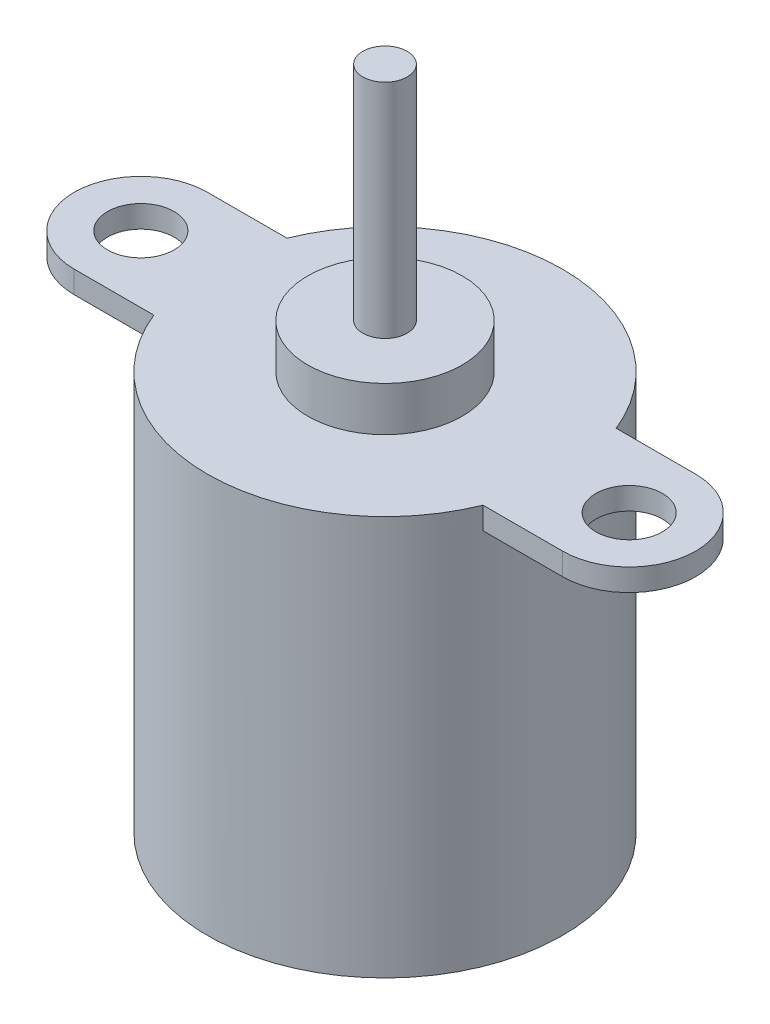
ISO-10303-21;
HEADER;
FILE_DESCRIPTION(('STEP AP214'),'2;1');
FILE_NAME('part.step','',(''),(''),'','','');
FILE_SCHEMA(('AUTOMOTIVE_DESIGN { 1 0 10303 214 1 1 1 1 }'));
ENDSEC;
DATA;
#1=APPLICATION_CONTEXT('core data for automotive mechanical design processes');
#2=APPLICATION_PROTOCOL_DEFINITION('international standard','automotive_design',2000,#1);
#3=PRODUCT_CONTEXT('',#1,'mechanical');
#4=PRODUCT('Part','Part','',(#3));
#5=PRODUCT_RELATED_PRODUCT_CATEGORY('part','',(#4));
#6=PRODUCT_DEFINITION_FORMATION('','',#4);
#7=PRODUCT_DEFINITION_CONTEXT('part definition',#1,'design');
#8=PRODUCT_DEFINITION('design','',#6,#7);
#9=PRODUCT_DEFINITION_SHAPE('','',#8);
#10=(LENGTH_UNIT() NAMED_UNIT(*) SI_UNIT(.MILLI.,.METRE.));
#11=(NAMED_UNIT(*) PLANE_ANGLE_UNIT() SI_UNIT($,.RADIAN.));
#12=(NAMED_UNIT(*) SI_UNIT($,.STERADIAN.) SOLID_ANGLE_UNIT());
#13=UNCERTAINTY_MEASURE_WITH_UNIT(LENGTH_MEASURE(1.E-05),#10,'distance_accuracy_value','');
#14=(GEOMETRIC_REPRESENTATION_CONTEXT(3) GLOBAL_UNCERTAINTY_ASSIGNED_CONTEXT((#13)) GLOBAL_UNIT_ASSIGNED_CONTEXT((#10,
#11,#12)) REPRESENTATION_CONTEXT('',''));
#15=CARTESIAN_POINT('',(0.,0.,0.));
#16=DIRECTION('',(0.,0.,1.));
#17=DIRECTION('',(1.,0.,0.));
#18=AXIS2_PLACEMENT_3D('',#15,#16,#17);
#19=CARTESIAN_POINT('',(0.,15.,0.));
#20=DIRECTION('',(0.,1.,0.));
#21=DIRECTION('',(0.,0.,1.));
#22=AXIS2_PLACEMENT_3D('',#19,#20,#21);
#23=PLANE('',#22);
#24=CARTESIAN_POINT('',(0.,15.,0.));
#25=DIRECTION('',(0.,-1.,0.));
#26=DIRECTION('',(0.,0.,-1.));
#27=AXIS2_PLACEMENT_3D('',#24,#25,#26);
#28=CIRCLE('',#27,0.5);
#29=CARTESIAN_POINT('',(0.,15.,-0.5));
#30=VERTEX_POINT('',#29);
#31=EDGE_CURVE('E20',#30,#30,#28,.T.);
#32=ORIENTED_EDGE('',*,*,#31,.F.);
#33=EDGE_LOOP('',(#32));
#34=FACE_BOUND('',#33,.T.);
#35=ADVANCED_FACE('F17',(#34),#23,.T.);
#36=CARTESIAN_POINT('',(0.,15.,0.));
#37=DIRECTION('',(0.,-1.,0.));
#38=DIRECTION('',(0.,0.,-1.));
#39=AXIS2_PLACEMENT_3D('',#36,#37,#38);
#40=CYLINDRICAL_SURFACE('',#39,0.5);
#41=CARTESIAN_POINT('',(0.,10.,0.));
#42=DIRECTION('',(0.,-1.,0.));
#43=DIRECTION('',(0.,0.,-1.));
#44=AXIS2_PLACEMENT_3D('',#41,#42,#43);
#45=CIRCLE('',#44,0.5);
#46=CARTESIAN_POINT('',(0.,10.,-0.5));
#47=VERTEX_POINT('',#46);
#48=EDGE_CURVE('E157',#47,#47,#45,.T.);
#49=ORIENTED_EDGE('',*,*,#48,.F.);
#50=EDGE_LOOP('',(#49));
#51=FACE_BOUND('',#50,.T.);
#52=ORIENTED_EDGE('',*,*,#31,.T.);
#53=EDGE_LOOP('',(#52));
#54=FACE_BOUND('',#53,.T.);
#55=ADVANCED_FACE('F164',(#51,#54),#40,.T.);
#56=CARTESIAN_POINT('',(0.,10.,0.));
#57=DIRECTION('',(0.,1.,0.));
#58=DIRECTION('',(0.,0.,1.));
#59=AXIS2_PLACEMENT_3D('',#56,#57,#58);
#60=PLANE('',#59);
#61=ORIENTED_EDGE('',*,*,#48,.T.);
#62=EDGE_LOOP('',(#61));
#63=FACE_BOUND('',#62,.T.);
#64=CARTESIAN_POINT('',(0.,10.,0.));
#65=DIRECTION('',(0.,-1.,0.));
#66=DIRECTION('',(0.,0.,-1.));
#67=AXIS2_PLACEMENT_3D('',#64,#65,#66);
#68=CIRCLE('',#67,1.74000566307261);
#69=CARTESIAN_POINT('',(0.,10.,-1.74000566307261));
#70=VERTEX_POINT('',#69);
#71=EDGE_CURVE('E102',#70,#70,#68,.T.);
#72=ORIENTED_EDGE('',*,*,#71,.F.);
#73=EDGE_LOOP('',(#72));
#74=FACE_BOUND('',#73,.T.);
#75=ADVANCED_FACE('F171',(#63,#74),#60,.T.);
#76=CARTESIAN_POINT('',(-5.5,8.5,0.));
#77=DIRECTION('',(0.,1.,0.));
#78=DIRECTION('',(0.,0.,1.));
#79=AXIS2_PLACEMENT_3D('',#76,#77,#78);
#80=PLANE('',#79);
#81=CARTESIAN_POINT('',(0.,8.5,0.));
#82=DIRECTION('',(0.,-1.,0.));
#83=DIRECTION('',(0.,0.,-1.));
#84=AXIS2_PLACEMENT_3D('',#81,#82,#83);
#85=CIRCLE('',#84,4.);
#86=CARTESIAN_POINT('',(-3.70809924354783,8.5,1.5));
#87=VERTEX_POINT('',#86);
#88=CARTESIAN_POINT('',(-3.70809924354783,8.5,-1.5));
#89=VERTEX_POINT('',#88);
#90=EDGE_CURVE('E98',#87,#89,#85,.T.);
#91=ORIENTED_EDGE('',*,*,#90,.F.);
#92=DIRECTION('',(1.,0.,0.));
#93=VECTOR('',#92,1.);
#94=CARTESIAN_POINT('',(-5.5,8.5,1.5));
#95=LINE('',#94,#93);
#96=CARTESIAN_POINT('',(-5.5,8.5,1.5));
#97=VERTEX_POINT('',#96);
#98=EDGE_CURVE('E94',#97,#87,#95,.T.);
#99=ORIENTED_EDGE('',*,*,#98,.F.);
#100=CARTESIAN_POINT('',(-5.5,8.5,0.));
#101=DIRECTION('',(0.,1.,0.));
#102=DIRECTION('',(0.,0.,1.));
#103=AXIS2_PLACEMENT_3D('',#100,#101,#102);
#104=CIRCLE('',#103,1.5);
#105=CARTESIAN_POINT('',(-5.5,8.5,-1.5));
#106=VERTEX_POINT('',#105);
#107=EDGE_CURVE('E83',#106,#97,#104,.T.);
#108=ORIENTED_EDGE('',*,*,#107,.F.);
#109=DIRECTION('',(-1.,0.,0.));
#110=VECTOR('',#109,1.);
#111=CARTESIAN_POINT('',(-5.5,8.5,-1.5));
#112=LINE('',#111,#110);
#113=EDGE_CURVE('E78',#89,#106,#112,.T.);
#114=ORIENTED_EDGE('',*,*,#113,.F.);
#115=EDGE_LOOP('',(#91,#99,#108,#114));
#116=FACE_BOUND('',#115,.T.);
#117=CARTESIAN_POINT('',(-5.5,8.5,0.));
#118=DIRECTION('',(0.,1.,0.));
#119=DIRECTION('',(0.,0.,1.));
#120=AXIS2_PLACEMENT_3D('',#117,#118,#119);
#121=CIRCLE('',#120,0.75);
#122=CARTESIAN_POINT('',(-5.5,8.5,0.75));
#123=VERTEX_POINT('',#122);
#124=EDGE_CURVE('E121',#123,#123,#121,.T.);
#125=ORIENTED_EDGE('',*,*,#124,.T.);
#126=EDGE_LOOP('',(#125));
#127=FACE_BOUND('',#126,.T.);
#128=ADVANCED_FACE('F95',(#116,#127),#80,.F.);
#129=CARTESIAN_POINT('',(-5.5,8.5,0.));
#130=DIRECTION('',(0.,1.,0.));
#131=DIRECTION('',(0.,0.,1.));
#132=AXIS2_PLACEMENT_3D('',#129,#130,#131);
#133=CYLINDRICAL_SURFACE('',#132,0.75);
#134=CARTESIAN_POINT('',(-5.5,9.,0.));
#135=DIRECTION('',(0.,1.,0.));
#136=DIRECTION('',(0.,0.,1.));
#137=AXIS2_PLACEMENT_3D('',#134,#135,#136);
#138=CIRCLE('',#137,0.75);
#139=CARTESIAN_POINT('',(-5.5,9.,0.75));
#140=VERTEX_POINT('',#139);
#141=EDGE_CURVE('E148',#140,#140,#138,.F.);
#142=ORIENTED_EDGE('',*,*,#141,.F.);
#143=EDGE_LOOP('',(#142));
#144=FACE_BOUND('',#143,.T.);
#145=ORIENTED_EDGE('',*,*,#124,.F.);
#146=EDGE_LOOP('',(#145));
#147=FACE_BOUND('',#146,.T.);
#148=ADVANCED_FACE('F219',(#144,#147),#133,.F.);
#149=CARTESIAN_POINT('',(-5.5,8.5,-1.5));
#150=DIRECTION('',(0.,0.,-1.));
#151=DIRECTION('',(-1.,0.,0.));
#152=AXIS2_PLACEMENT_3D('',#149,#150,#151);
#153=PLANE('',#152);
#154=DIRECTION('',(0.,1.,0.));
#155=VECTOR('',#154,1.);
#156=CARTESIAN_POINT('',(-5.5,8.5,-1.5));
#157=LINE('',#156,#155);
#158=CARTESIAN_POINT('',(-5.5,9.,-1.5));
#159=VERTEX_POINT('',#158);
#160=EDGE_CURVE('E90',#159,#106,#157,.F.);
#161=ORIENTED_EDGE('',*,*,#160,.F.);
#162=DIRECTION('',(1.,0.,0.));
#163=VECTOR('',#162,1.);
#164=CARTESIAN_POINT('',(0.,9.,-1.5));
#165=LINE('',#164,#163);
#166=CARTESIAN_POINT('',(-3.70809924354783,9.,-1.5));
#167=VERTEX_POINT('',#166);
#168=EDGE_CURVE('E142',#167,#159,#165,.F.);
#169=ORIENTED_EDGE('',*,*,#168,.F.);
#170=DIRECTION('',(0.,-1.,0.));
#171=VECTOR('',#170,1.);
#172=CARTESIAN_POINT('',(-3.70809924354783,9.,-1.5));
#173=LINE('',#172,#171);
#174=EDGE_CURVE('E114',#89,#167,#173,.F.);
#175=ORIENTED_EDGE('',*,*,#174,.F.);
#176=ORIENTED_EDGE('',*,*,#113,.T.);
#177=EDGE_LOOP('',(#161,#169,#175,#176));
#178=FACE_BOUND('',#177,.T.);
#179=ADVANCED_FACE('F216',(#178),#153,.T.);
#180=CARTESIAN_POINT('',(-5.5,8.5,0.));
#181=DIRECTION('',(0.,1.,0.));
#182=DIRECTION('',(0.,0.,1.));
#183=AXIS2_PLACEMENT_3D('',#180,#181,#182);
#184=CYLINDRICAL_SURFACE('',#183,1.5);
#185=ORIENTED_EDGE('',*,*,#107,.T.);
#186=DIRECTION('',(0.,1.,0.));
#187=VECTOR('',#186,1.);
#188=CARTESIAN_POINT('',(-5.5,8.5,1.5));
#189=LINE('',#188,#187);
#190=CARTESIAN_POINT('',(-5.5,9.,1.5));
#191=VERTEX_POINT('',#190);
#192=EDGE_CURVE('E88',#191,#97,#189,.F.);
#193=ORIENTED_EDGE('',*,*,#192,.F.);
#194=CARTESIAN_POINT('',(-5.5,9.,0.));
#195=DIRECTION('',(0.,1.,0.));
#196=DIRECTION('',(0.,0.,1.));
#197=AXIS2_PLACEMENT_3D('',#194,#195,#196);
#198=CIRCLE('',#197,1.5);
#199=EDGE_CURVE('E140',#159,#191,#198,.T.);
#200=ORIENTED_EDGE('',*,*,#199,.F.);
#201=ORIENTED_EDGE('',*,*,#160,.T.);
#202=EDGE_LOOP('',(#185,#193,#200,#201));
#203=FACE_BOUND('',#202,.T.);
#204=ADVANCED_FACE('F85',(#203),#184,.T.);
#205=CARTESIAN_POINT('',(-5.5,8.5,1.5));
#206=DIRECTION('',(0.,0.,1.));
#207=DIRECTION('',(1.,0.,0.));
#208=AXIS2_PLACEMENT_3D('',#205,#206,#207);
#209=PLANE('',#208);
#210=ORIENTED_EDGE('',*,*,#192,.T.);
#211=ORIENTED_EDGE('',*,*,#98,.T.);
#212=DIRECTION('',(0.,-1.,0.));
#213=VECTOR('',#212,1.);
#214=CARTESIAN_POINT('',(-3.70809924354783,9.,1.5));
#215=LINE('',#214,#213);
#216=CARTESIAN_POINT('',(-3.70809924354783,9.,1.5));
#217=VERTEX_POINT('',#216);
#218=EDGE_CURVE('E118',#217,#87,#215,.T.);
#219=ORIENTED_EDGE('',*,*,#218,.F.);
#220=DIRECTION('',(1.,0.,0.));
#221=VECTOR('',#220,1.);
#222=CARTESIAN_POINT('',(0.,9.,1.5));
#223=LINE('',#222,#221);
#224=EDGE_CURVE('E106',#191,#217,#223,.T.);
#225=ORIENTED_EDGE('',*,*,#224,.F.);
#226=EDGE_LOOP('',(#210,#211,#219,#225));
#227=FACE_BOUND('',#226,.T.);
#228=ADVANCED_FACE('F104',(#227),#209,.T.);
#229=CARTESIAN_POINT('',(0.,10.,0.));
#230=DIRECTION('',(0.,-1.,0.));
#231=DIRECTION('',(0.,0.,-1.));
#232=AXIS2_PLACEMENT_3D('',#229,#230,#231);
#233=CYLINDRICAL_SURFACE('',#232,1.74000566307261);
#234=CARTESIAN_POINT('',(0.,9.,0.));
#235=DIRECTION('',(0.,-1.,0.));
#236=DIRECTION('',(0.,0.,-1.));
#237=AXIS2_PLACEMENT_3D('',#234,#235,#236);
#238=CIRCLE('',#237,1.74000566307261);
#239=CARTESIAN_POINT('',(0.,9.,-1.74000566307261));
#240=VERTEX_POINT('',#239);
#241=EDGE_CURVE('E137',#240,#240,#238,.T.);
#242=ORIENTED_EDGE('',*,*,#241,.F.);
#243=EDGE_LOOP('',(#242));
#244=FACE_BOUND('',#243,.T.);
#245=ORIENTED_EDGE('',*,*,#71,.T.);
#246=EDGE_LOOP('',(#245));
#247=FACE_BOUND('',#246,.T.);
#248=ADVANCED_FACE('F207',(#244,#247),#233,.T.);
#249=CARTESIAN_POINT('',(5.5,8.5,0.));
#250=DIRECTION('',(0.,1.,0.));
#251=DIRECTION('',(0.,0.,1.));
#252=AXIS2_PLACEMENT_3D('',#249,#250,#251);
#253=CYLINDRICAL_SURFACE('',#252,0.75);
#254=CARTESIAN_POINT('',(5.5,8.5,0.));
#255=DIRECTION('',(0.,1.,0.));
#256=DIRECTION('',(0.,0.,1.));
#257=AXIS2_PLACEMENT_3D('',#254,#255,#256);
#258=CIRCLE('',#257,0.75);
#259=CARTESIAN_POINT('',(5.5,8.5,0.749999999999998));
#260=VERTEX_POINT('',#259);
#261=EDGE_CURVE('E134',#260,#260,#258,.F.);
#262=ORIENTED_EDGE('',*,*,#261,.T.);
#263=EDGE_LOOP('',(#262));
#264=FACE_BOUND('',#263,.T.);
#265=CARTESIAN_POINT('',(5.5,9.,0.));
#266=DIRECTION('',(0.,1.,0.));
#267=DIRECTION('',(0.,0.,1.));
#268=AXIS2_PLACEMENT_3D('',#265,#266,#267);
#269=CIRCLE('',#268,0.75);
#270=CARTESIAN_POINT('',(5.5,9.,0.749999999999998));
#271=VERTEX_POINT('',#270);
#272=EDGE_CURVE('E117',#271,#271,#269,.F.);
#273=ORIENTED_EDGE('',*,*,#272,.F.);
#274=EDGE_LOOP('',(#273));
#275=FACE_BOUND('',#274,.T.);
#276=ADVANCED_FACE('F203',(#264,#275),#253,.F.);
#277=CARTESIAN_POINT('',(5.5,8.5,0.));
#278=DIRECTION('',(0.,1.,0.));
#279=DIRECTION('',(0.,0.,1.));
#280=AXIS2_PLACEMENT_3D('',#277,#278,#279);
#281=CYLINDRICAL_SURFACE('',#280,1.5);
#282=CARTESIAN_POINT('',(5.5,8.5,0.));
#283=DIRECTION('',(0.,1.,0.));
#284=DIRECTION('',(0.,0.,1.));
#285=AXIS2_PLACEMENT_3D('',#282,#283,#284);
#286=CIRCLE('',#285,1.5);
#287=CARTESIAN_POINT('',(5.5,8.5,1.5));
#288=VERTEX_POINT('',#287);
#289=CARTESIAN_POINT('',(5.5,8.5,-1.5));
#290=VERTEX_POINT('',#289);
#291=EDGE_CURVE('E131',#288,#290,#286,.T.);
#292=ORIENTED_EDGE('',*,*,#291,.T.);
#293=DIRECTION('',(0.,1.,0.));
#294=VECTOR('',#293,1.);
#295=CARTESIAN_POINT('',(5.5,8.5,-1.5));
#296=LINE('',#295,#294);
#297=CARTESIAN_POINT('',(5.5,9.,-1.5));
#298=VERTEX_POINT('',#297);
#299=EDGE_CURVE('E384',#298,#290,#296,.F.);
#300=ORIENTED_EDGE('',*,*,#299,.F.);
#301=CARTESIAN_POINT('',(5.5,9.,0.));
#302=DIRECTION('',(0.,1.,0.));
#303=DIRECTION('',(0.,0.,1.));
#304=AXIS2_PLACEMENT_3D('',#301,#302,#303);
#305=CIRCLE('',#304,1.5);
#306=CARTESIAN_POINT('',(5.5,9.,1.5));
#307=VERTEX_POINT('',#306);
#308=EDGE_CURVE('E143',#307,#298,#305,.T.);
#309=ORIENTED_EDGE('',*,*,#308,.F.);
#310=DIRECTION('',(0.,1.,0.));
#311=VECTOR('',#310,1.);
#312=CARTESIAN_POINT('',(5.5,8.5,1.5));
#313=LINE('',#312,#311);
#314=EDGE_CURVE('E120',#288,#307,#313,.T.);
#315=ORIENTED_EDGE('',*,*,#314,.F.);
#316=EDGE_LOOP('',(#292,#300,#309,#315));
#317=FACE_BOUND('',#316,.T.);
#318=ADVANCED_FACE('F199',(#317),#281,.T.);
#319=CARTESIAN_POINT('',(-5.5,8.5,-1.5));
#320=DIRECTION('',(0.,0.,-1.));
#321=DIRECTION('',(-1.,0.,0.));
#322=AXIS2_PLACEMENT_3D('',#319,#320,#321);
#323=PLANE('',#322);
#324=ORIENTED_EDGE('',*,*,#299,.T.);
#325=DIRECTION('',(1.,0.,0.));
#326=VECTOR('',#325,1.);
#327=CARTESIAN_POINT('',(-5.5,8.5,-1.5));
#328=LINE('',#327,#326);
#329=CARTESIAN_POINT('',(3.70809924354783,8.5,-1.5));
#330=VERTEX_POINT('',#329);
#331=EDGE_CURVE('E133',#290,#330,#328,.F.);
#332=ORIENTED_EDGE('',*,*,#331,.T.);
#333=DIRECTION('',(0.,1.,0.));
#334=VECTOR('',#333,1.);
#335=CARTESIAN_POINT('',(3.70809924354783,8.5,-1.5));
#336=LINE('',#335,#334);
#337=CARTESIAN_POINT('',(3.70809924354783,9.,-1.5));
#338=VERTEX_POINT('',#337);
#339=EDGE_CURVE('E111',#330,#338,#336,.T.);
#340=ORIENTED_EDGE('',*,*,#339,.T.);
#341=DIRECTION('',(1.,0.,0.));
#342=VECTOR('',#341,1.);
#343=CARTESIAN_POINT('',(0.,9.,-1.5));
#344=LINE('',#343,#342);
#345=EDGE_CURVE('E146',#298,#338,#344,.F.);
#346=ORIENTED_EDGE('',*,*,#345,.F.);
#347=EDGE_LOOP('',(#324,#332,#340,#346));
#348=FACE_BOUND('',#347,.T.);
#349=ADVANCED_FACE('F196',(#348),#323,.T.);
#350=CARTESIAN_POINT('',(-5.5,8.5,1.5));
#351=DIRECTION('',(0.,0.,1.));
#352=DIRECTION('',(1.,0.,0.));
#353=AXIS2_PLACEMENT_3D('',#350,#351,#352);
#354=PLANE('',#353);
#355=ORIENTED_EDGE('',*,*,#314,.T.);
#356=DIRECTION('',(1.,0.,0.));
#357=VECTOR('',#356,1.);
#358=CARTESIAN_POINT('',(0.,9.,1.5));
#359=LINE('',#358,#357);
#360=CARTESIAN_POINT('',(3.70809924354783,9.,1.5));
#361=VERTEX_POINT('',#360);
#362=EDGE_CURVE('E147',#361,#307,#359,.T.);
#363=ORIENTED_EDGE('',*,*,#362,.F.);
#364=DIRECTION('',(0.,1.,0.));
#365=VECTOR('',#364,1.);
#366=CARTESIAN_POINT('',(3.70809924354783,8.5,1.5));
#367=LINE('',#366,#365);
#368=CARTESIAN_POINT('',(3.70809924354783,8.5,1.5));
#369=VERTEX_POINT('',#368);
#370=EDGE_CURVE('E35',#361,#369,#367,.F.);
#371=ORIENTED_EDGE('',*,*,#370,.T.);
#372=DIRECTION('',(1.,0.,0.));
#373=VECTOR('',#372,1.);
#374=CARTESIAN_POINT('',(-5.5,8.5,1.5));
#375=LINE('',#374,#373);
#376=EDGE_CURVE('E130',#369,#288,#375,.T.);
#377=ORIENTED_EDGE('',*,*,#376,.T.);
#378=EDGE_LOOP('',(#355,#363,#371,#377));
#379=FACE_BOUND('',#378,.T.);
#380=ADVANCED_FACE('F192',(#379),#354,.T.);
#381=CARTESIAN_POINT('',(0.,0.,0.));
#382=DIRECTION('',(0.,1.,0.));
#383=DIRECTION('',(0.,0.,1.));
#384=AXIS2_PLACEMENT_3D('',#381,#382,#383);
#385=PLANE('',#384);
#386=CARTESIAN_POINT('',(0.,0.,0.));
#387=DIRECTION('',(0.,-1.,0.));
#388=DIRECTION('',(0.,0.,-1.));
#389=AXIS2_PLACEMENT_3D('',#386,#387,#388);
#390=CIRCLE('',#389,4.);
#391=CARTESIAN_POINT('',(0.,0.,-4.));
#392=VERTEX_POINT('',#391);
#393=EDGE_CURVE('E125',#392,#392,#390,.F.);
#394=ORIENTED_EDGE('',*,*,#393,.F.);
#395=EDGE_LOOP('',(#394));
#396=FACE_BOUND('',#395,.T.);
#397=ADVANCED_FACE('F188',(#396),#385,.F.);
#398=CARTESIAN_POINT('',(0.,9.,0.));
#399=DIRECTION('',(0.,1.,0.));
#400=DIRECTION('',(0.,0.,1.));
#401=AXIS2_PLACEMENT_3D('',#398,#399,#400);
#402=PLANE('',#401);
#403=ORIENTED_EDGE('',*,*,#241,.T.);
#404=EDGE_LOOP('',(#403));
#405=FACE_BOUND('',#404,.T.);
#406=ORIENTED_EDGE('',*,*,#199,.T.);
#407=ORIENTED_EDGE('',*,*,#224,.T.);
#408=CARTESIAN_POINT('',(0.,9.,0.));
#409=DIRECTION('',(0.,-1.,0.));
#410=DIRECTION('',(0.,0.,-1.));
#411=AXIS2_PLACEMENT_3D('',#408,#409,#410);
#412=CIRCLE('',#411,4.);
#413=EDGE_CURVE('E128',#361,#217,#412,.T.);
#414=ORIENTED_EDGE('',*,*,#413,.F.);
#415=ORIENTED_EDGE('',*,*,#362,.T.);
#416=ORIENTED_EDGE('',*,*,#308,.T.);
#417=ORIENTED_EDGE('',*,*,#345,.T.);
#418=CARTESIAN_POINT('',(0.,9.,0.));
#419=DIRECTION('',(0.,-1.,0.));
#420=DIRECTION('',(0.,0.,-1.));
#421=AXIS2_PLACEMENT_3D('',#418,#419,#420);
#422=CIRCLE('',#421,4.);
#423=EDGE_CURVE('E26',#167,#338,#422,.T.);
#424=ORIENTED_EDGE('',*,*,#423,.F.);
#425=ORIENTED_EDGE('',*,*,#168,.T.);
#426=EDGE_LOOP('',(#406,#407,#414,#415,#416,#417,#424,#425));
#427=FACE_BOUND('',#426,.T.);
#428=ORIENTED_EDGE('',*,*,#141,.T.);
#429=EDGE_LOOP('',(#428));
#430=FACE_BOUND('',#429,.T.);
#431=ORIENTED_EDGE('',*,*,#272,.T.);
#432=EDGE_LOOP('',(#431));
#433=FACE_BOUND('',#432,.T.);
#434=ADVANCED_FACE('F181',(#405,#427,#430,#433),#402,.T.);
#435=CARTESIAN_POINT('',(-5.5,8.5,0.));
#436=DIRECTION('',(0.,1.,0.));
#437=DIRECTION('',(0.,0.,1.));
#438=AXIS2_PLACEMENT_3D('',#435,#436,#437);
#439=PLANE('',#438);
#440=CARTESIAN_POINT('',(0.,8.5,0.));
#441=DIRECTION('',(0.,-1.,0.));
#442=DIRECTION('',(0.,0.,-1.));
#443=AXIS2_PLACEMENT_3D('',#440,#441,#442);
#444=CIRCLE('',#443,4.);
#445=EDGE_CURVE('E11',#330,#369,#444,.T.);
#446=ORIENTED_EDGE('',*,*,#445,.F.);
#447=ORIENTED_EDGE('',*,*,#331,.F.);
#448=ORIENTED_EDGE('',*,*,#291,.F.);
#449=ORIENTED_EDGE('',*,*,#376,.F.);
#450=EDGE_LOOP('',(#446,#447,#448,#449));
#451=FACE_BOUND('',#450,.T.);
#452=ORIENTED_EDGE('',*,*,#261,.F.);
#453=EDGE_LOOP('',(#452));
#454=FACE_BOUND('',#453,.T.);
#455=ADVANCED_FACE('F175',(#451,#454),#439,.F.);
#456=CARTESIAN_POINT('',(0.,9.,0.));
#457=DIRECTION('',(0.,-1.,0.));
#458=DIRECTION('',(0.,0.,-1.));
#459=AXIS2_PLACEMENT_3D('',#456,#457,#458);
#460=CYLINDRICAL_SURFACE('',#459,4.);
#461=ORIENTED_EDGE('',*,*,#393,.T.);
#462=EDGE_LOOP('',(#461));
#463=FACE_BOUND('',#462,.T.);
#464=ORIENTED_EDGE('',*,*,#445,.T.);
#465=ORIENTED_EDGE('',*,*,#370,.F.);
#466=ORIENTED_EDGE('',*,*,#413,.T.);
#467=ORIENTED_EDGE('',*,*,#218,.T.);
#468=ORIENTED_EDGE('',*,*,#90,.T.);
#469=ORIENTED_EDGE('',*,*,#174,.T.);
#470=ORIENTED_EDGE('',*,*,#423,.T.);
#471=ORIENTED_EDGE('',*,*,#339,.F.);
#472=EDGE_LOOP('',(#464,#465,#466,#467,#468,#469,#470,#471));
#473=FACE_BOUND('',#472,.T.);
#474=ADVANCED_FACE('F173',(#463,#473),#460,.T.);
#475=CLOSED_SHELL('',(#35,#55,#75,#128,#148,#179,#204,#228,#248,#276,#318,#349,#380,#397,#434,
#455,#474));
#476=MANIFOLD_SOLID_BREP('B1',#475);
#477=ADVANCED_BREP_SHAPE_REPRESENTATION('',(#18,#476),#14);
#478=SHAPE_DEFINITION_REPRESENTATION(#9,#477);
ENDSEC;
END-ISO-10303-21;
